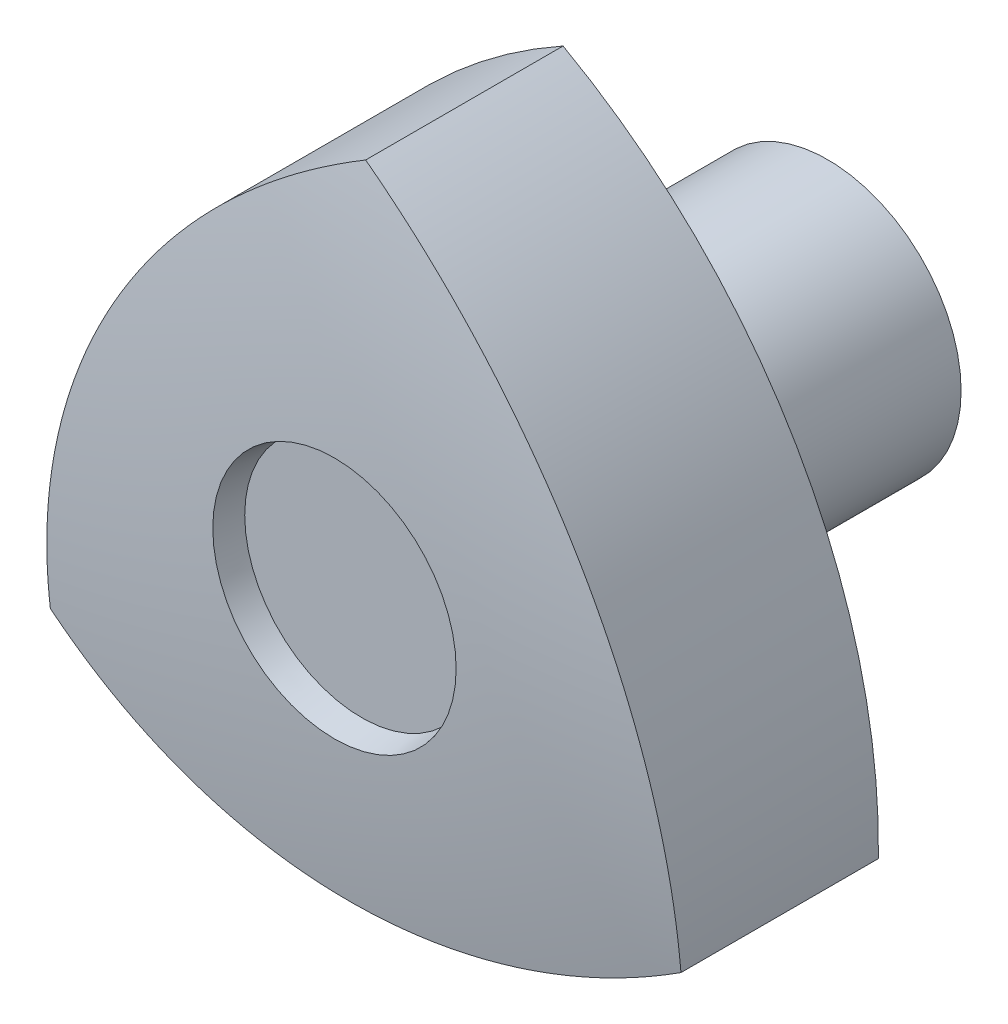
ISO-10303-21;
HEADER;
FILE_DESCRIPTION(('STEP AP214'),'2;1');
FILE_NAME('part.step','',(''),(''),'','','');
FILE_SCHEMA(('AUTOMOTIVE_DESIGN { 1 0 10303 214 1 1 1 1 }'));
ENDSEC;
DATA;
#1=APPLICATION_CONTEXT('core data for automotive mechanical design processes');
#2=APPLICATION_PROTOCOL_DEFINITION('international standard','automotive_design',2000,#1);
#3=PRODUCT_CONTEXT('',#1,'mechanical');
#4=PRODUCT('Part','Part','',(#3));
#5=PRODUCT_RELATED_PRODUCT_CATEGORY('part','',(#4));
#6=PRODUCT_DEFINITION_FORMATION('','',#4);
#7=PRODUCT_DEFINITION_CONTEXT('part definition',#1,'design');
#8=PRODUCT_DEFINITION('design','',#6,#7);
#9=PRODUCT_DEFINITION_SHAPE('','',#8);
#10=(LENGTH_UNIT() NAMED_UNIT(*) SI_UNIT(.MILLI.,.METRE.));
#11=(NAMED_UNIT(*) PLANE_ANGLE_UNIT() SI_UNIT($,.RADIAN.));
#12=(NAMED_UNIT(*) SI_UNIT($,.STERADIAN.) SOLID_ANGLE_UNIT());
#13=UNCERTAINTY_MEASURE_WITH_UNIT(LENGTH_MEASURE(1.E-05),#10,'distance_accuracy_value','');
#14=(GEOMETRIC_REPRESENTATION_CONTEXT(3) GLOBAL_UNCERTAINTY_ASSIGNED_CONTEXT((#13)) GLOBAL_UNIT_ASSIGNED_CONTEXT((#10,
#11,#12)) REPRESENTATION_CONTEXT('',''));
#15=CARTESIAN_POINT('',(0.,0.,0.));
#16=DIRECTION('',(0.,0.,1.));
#17=DIRECTION('',(1.,0.,0.));
#18=AXIS2_PLACEMENT_3D('',#15,#16,#17);
#19=CARTESIAN_POINT('',(0.,-6.,0.));
#20=DIRECTION('',(0.,0.,1.));
#21=DIRECTION('',(-1.,0.,0.));
#22=AXIS2_PLACEMENT_3D('',#19,#20,#21);
#23=PLANE('',#22);
#24=CARTESIAN_POINT('',(0.,0.,0.));
#25=DIRECTION('',(0.,0.,-1.));
#26=DIRECTION('',(-1.,0.,0.));
#27=AXIS2_PLACEMENT_3D('',#24,#25,#26);
#28=CIRCLE('',#27,6.);
#29=CARTESIAN_POINT('',(-6.,0.,0.));
#30=VERTEX_POINT('',#29);
#31=EDGE_CURVE('E126',#30,#30,#28,.T.);
#32=ORIENTED_EDGE('',*,*,#31,.F.);
#33=EDGE_LOOP('',(#32));
#34=FACE_BOUND('',#33,.T.);
#35=CARTESIAN_POINT('',(0.,0.,0.));
#36=DIRECTION('',(0.,0.,-1.));
#37=DIRECTION('',(1.,0.,0.));
#38=AXIS2_PLACEMENT_3D('',#35,#36,#37);
#39=CIRCLE('',#38,7.8);
#40=CARTESIAN_POINT('',(7.8,0.,0.));
#41=VERTEX_POINT('',#40);
#42=EDGE_CURVE('E117',#41,#41,#39,.F.);
#43=ORIENTED_EDGE('',*,*,#42,.F.);
#44=EDGE_LOOP('',(#43));
#45=FACE_BOUND('',#44,.T.);
#46=ADVANCED_FACE('F14',(#34,#45),#23,.F.);
#47=CARTESIAN_POINT('',(0.,0.,38.6));
#48=DIRECTION('',(0.,0.,-1.));
#49=DIRECTION('',(1.,0.,0.));
#50=AXIS2_PLACEMENT_3D('',#47,#48,#49);
#51=CYLINDRICAL_SURFACE('',#50,7.8);
#52=ORIENTED_EDGE('',*,*,#42,.T.);
#53=EDGE_LOOP('',(#52));
#54=FACE_BOUND('',#53,.T.);
#55=CARTESIAN_POINT('',(0.,0.,0.200000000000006));
#56=DIRECTION('',(0.,0.,-1.));
#57=DIRECTION('',(1.,0.,0.));
#58=AXIS2_PLACEMENT_3D('',#55,#56,#57);
#59=CIRCLE('',#58,7.8);
#60=CARTESIAN_POINT('',(7.8,0.,0.200000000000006));
#61=VERTEX_POINT('',#60);
#62=EDGE_CURVE('E115',#61,#61,#59,.T.);
#63=ORIENTED_EDGE('',*,*,#62,.T.);
#64=EDGE_LOOP('',(#63));
#65=FACE_BOUND('',#64,.T.);
#66=ADVANCED_FACE('F166',(#54,#65),#51,.T.);
#67=CARTESIAN_POINT('',(0.,-7.8,0.200000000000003));
#68=DIRECTION('',(0.,0.,1.));
#69=DIRECTION('',(-1.,0.,0.));
#70=AXIS2_PLACEMENT_3D('',#67,#68,#69);
#71=PLANE('',#70);
#72=ORIENTED_EDGE('',*,*,#62,.F.);
#73=EDGE_LOOP('',(#72));
#74=FACE_BOUND('',#73,.T.);
#75=CARTESIAN_POINT('',(0.,0.,0.200000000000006));
#76=DIRECTION('',(0.,0.,-1.));
#77=DIRECTION('',(1.,0.,0.));
#78=AXIS2_PLACEMENT_3D('',#75,#76,#77);
#79=CIRCLE('',#78,11.);
#80=CARTESIAN_POINT('',(11.,0.,0.200000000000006));
#81=VERTEX_POINT('',#80);
#82=EDGE_CURVE('E112',#81,#81,#79,.F.);
#83=ORIENTED_EDGE('',*,*,#82,.F.);
#84=EDGE_LOOP('',(#83));
#85=FACE_BOUND('',#84,.T.);
#86=ADVANCED_FACE('F159',(#74,#85),#71,.F.);
#87=CARTESIAN_POINT('',(0.,0.,38.6));
#88=DIRECTION('',(0.,0.,-1.));
#89=DIRECTION('',(1.,0.,0.));
#90=AXIS2_PLACEMENT_3D('',#87,#88,#89);
#91=CYLINDRICAL_SURFACE('',#90,11.);
#92=ORIENTED_EDGE('',*,*,#82,.T.);
#93=EDGE_LOOP('',(#92));
#94=FACE_BOUND('',#93,.T.);
#95=CARTESIAN_POINT('',(0.,0.,22.));
#96=DIRECTION('',(0.,0.,-1.));
#97=DIRECTION('',(1.,0.,0.));
#98=AXIS2_PLACEMENT_3D('',#95,#96,#97);
#99=CIRCLE('',#98,11.);
#100=CARTESIAN_POINT('',(11.,0.,22.));
#101=VERTEX_POINT('',#100);
#102=EDGE_CURVE('E58',#101,#101,#99,.T.);
#103=ORIENTED_EDGE('',*,*,#102,.T.);
#104=EDGE_LOOP('',(#103));
#105=FACE_BOUND('',#104,.T.);
#106=ADVANCED_FACE('F154',(#94,#105),#91,.T.);
#107=CARTESIAN_POINT('',(0.,-11.,22.));
#108=DIRECTION('',(0.,0.,1.));
#109=DIRECTION('',(-1.,0.,0.));
#110=AXIS2_PLACEMENT_3D('',#107,#108,#109);
#111=PLANE('',#110);
#112=ORIENTED_EDGE('',*,*,#102,.F.);
#113=EDGE_LOOP('',(#112));
#114=FACE_BOUND('',#113,.T.);
#115=CARTESIAN_POINT('',(24.4868682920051,-14.1375,22.));
#116=DIRECTION('',(0.,0.,1.));
#117=DIRECTION('',(-1.,0.,0.));
#118=AXIS2_PLACEMENT_3D('',#115,#116,#117);
#119=CIRCLE('',#118,50.475);
#120=CARTESIAN_POINT('',(0.,30.,22.));
#121=VERTEX_POINT('',#120);
#122=CARTESIAN_POINT('',(-25.9807621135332,-14.9999999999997,22.));
#123=VERTEX_POINT('',#122);
#124=EDGE_CURVE('E62',#121,#123,#119,.T.);
#125=ORIENTED_EDGE('',*,*,#124,.F.);
#126=CARTESIAN_POINT('',(-24.486868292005,-14.1375,22.));
#127=DIRECTION('',(0.,0.,1.));
#128=DIRECTION('',(-1.,0.,0.));
#129=AXIS2_PLACEMENT_3D('',#126,#127,#128);
#130=CIRCLE('',#129,50.475);
#131=CARTESIAN_POINT('',(25.9807621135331,-15.,22.));
#132=VERTEX_POINT('',#131);
#133=EDGE_CURVE('E60',#132,#121,#130,.T.);
#134=ORIENTED_EDGE('',*,*,#133,.F.);
#135=CARTESIAN_POINT('',(0.,28.275,22.));
#136=DIRECTION('',(0.,0.,1.));
#137=DIRECTION('',(-1.,0.,0.));
#138=AXIS2_PLACEMENT_3D('',#135,#136,#137);
#139=CIRCLE('',#138,50.475);
#140=EDGE_CURVE('E49',#123,#132,#139,.T.);
#141=ORIENTED_EDGE('',*,*,#140,.F.);
#142=EDGE_LOOP('',(#125,#134,#141));
#143=FACE_BOUND('',#142,.T.);
#144=ADVANCED_FACE('F61',(#114,#143),#111,.F.);
#145=CARTESIAN_POINT('',(0.,-9.63233580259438,38.6));
#146=DIRECTION('',(0.,0.,-1.));
#147=DIRECTION('',(1.,0.,0.));
#148=AXIS2_PLACEMENT_3D('',#145,#146,#147);
#149=PLANE('',#148);
#150=CARTESIAN_POINT('',(0.,0.,38.6));
#151=DIRECTION('',(0.,0.,1.));
#152=DIRECTION('',(-1.,0.,0.));
#153=AXIS2_PLACEMENT_3D('',#150,#151,#152);
#154=CIRCLE('',#153,9.63233580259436);
#155=CARTESIAN_POINT('',(-9.63233580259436,0.,38.6));
#156=VERTEX_POINT('',#155);
#157=EDGE_CURVE('E106',#156,#156,#154,.T.);
#158=ORIENTED_EDGE('',*,*,#157,.T.);
#159=EDGE_LOOP('',(#158));
#160=FACE_BOUND('',#159,.T.);
#161=ADVANCED_FACE('F98',(#160),#149,.F.);
#162=CARTESIAN_POINT('',(0.,28.275,60.));
#163=DIRECTION('',(0.,0.,1.));
#164=DIRECTION('',(-1.,0.,0.));
#165=AXIS2_PLACEMENT_3D('',#162,#163,#164);
#166=CYLINDRICAL_SURFACE('',#165,50.475);
#167=DIRECTION('',(0.,0.,1.));
#168=VECTOR('',#167,1.);
#169=CARTESIAN_POINT('',(-25.9807621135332,-14.9999999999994,60.));
#170=LINE('',#169,#168);
#171=CARTESIAN_POINT('',(-25.9807621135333,-14.9999999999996,38.2666666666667));
#172=VERTEX_POINT('',#171);
#173=EDGE_CURVE('E56',#123,#172,#170,.T.);
#174=ORIENTED_EDGE('',*,*,#173,.F.);
#175=ORIENTED_EDGE('',*,*,#140,.T.);
#176=DIRECTION('',(0.,0.,1.));
#177=VECTOR('',#176,1.);
#178=CARTESIAN_POINT('',(25.9807621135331,-15.0000000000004,60.));
#179=LINE('',#178,#177);
#180=CARTESIAN_POINT('',(25.9807621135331,-15.0000000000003,38.2666666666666));
#181=VERTEX_POINT('',#180);
#182=EDGE_CURVE('E54',#181,#132,#179,.F.);
#183=ORIENTED_EDGE('',*,*,#182,.F.);
#184=CARTESIAN_POINT('',(-25.9807621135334,-14.9999999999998,38.2666666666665));
#185=CARTESIAN_POINT('',(-25.4333646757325,-15.3286377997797,38.3303674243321));
#186=CARTESIAN_POINT('',(-24.8796016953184,-15.6469655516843,38.3919197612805));
#187=CARTESIAN_POINT('',(-23.7600350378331,-16.2625632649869,38.5106833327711));
#188=CARTESIAN_POINT('',(-23.1942313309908,-16.5598331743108,38.5678945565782));
#189=CARTESIAN_POINT('',(-21.4800854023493,-17.419253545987,38.73292211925));
#190=CARTESIAN_POINT('',(-20.314733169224,-17.9491798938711,38.8341643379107));
#191=CARTESIAN_POINT('',(-17.9460386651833,-18.919318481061,39.0187399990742));
#192=CARTESIAN_POINT('',(-16.7426967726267,-19.3595316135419,39.1020736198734));
#193=CARTESIAN_POINT('',(-14.3049330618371,-20.1474680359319,39.2506711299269));
#194=CARTESIAN_POINT('',(-13.0705096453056,-20.4951865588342,39.3159340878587));
#195=CARTESIAN_POINT('',(-10.461080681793,-21.1239590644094,39.4335816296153));
#196=CARTESIAN_POINT('',(-9.08374319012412,-21.3957097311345,39.484185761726));
#197=CARTESIAN_POINT('',(-6.31052709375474,-21.8236189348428,39.5636971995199));
#198=CARTESIAN_POINT('',(-4.91464705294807,-21.9797684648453,39.592602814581));
#199=CARTESIAN_POINT('',(-2.11416082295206,-22.1752381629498,39.6287660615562));
#200=CARTESIAN_POINT('',(-0.709552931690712,-22.2145347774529,39.6360193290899));
#201=CARTESIAN_POINT('',(2.09792344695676,-22.1759176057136,39.6288830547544));
#202=CARTESIAN_POINT('',(3.50079202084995,-22.0980099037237,39.6144946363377));
#203=CARTESIAN_POINT('',(6.28771921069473,-21.826303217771,39.5641714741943));
#204=CARTESIAN_POINT('',(7.67183699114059,-21.6330902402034,39.5283456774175));
#205=CARTESIAN_POINT('',(10.4187751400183,-21.1327305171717,39.4351850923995));
#206=CARTESIAN_POINT('',(11.7815929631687,-20.8255702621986,39.3778477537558));
#207=CARTESIAN_POINT('',(14.474536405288,-20.1001609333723,39.2417613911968));
#208=CARTESIAN_POINT('',(15.8046966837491,-19.6820357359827,39.1630362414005));
#209=CARTESIAN_POINT('',(18.4242372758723,-18.7378678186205,38.984301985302));
#210=CARTESIAN_POINT('',(19.7136361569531,-18.2118750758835,38.8843027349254));
#211=CARTESIAN_POINT('',(21.4075776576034,-17.4378499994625,38.7363291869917));
#212=CARTESIAN_POINT('',(21.8342926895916,-17.235573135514,38.6975947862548));
#213=CARTESIAN_POINT('',(22.6816334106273,-16.8192546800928,38.6177315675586));
#214=CARTESIAN_POINT('',(23.1022604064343,-16.6052156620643,38.5766032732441));
#215=CARTESIAN_POINT('',(23.9363879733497,-16.1659355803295,38.4920437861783));
#216=CARTESIAN_POINT('',(24.349900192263,-15.9407157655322,38.4486169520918));
#217=CARTESIAN_POINT('',(25.1703585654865,-15.4788612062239,38.3594040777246));
#218=CARTESIAN_POINT('',(25.5773033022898,-15.2422240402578,38.3136175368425));
#219=CARTESIAN_POINT('',(25.980762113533,-15.,38.2666666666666));
#220=B_SPLINE_CURVE_WITH_KNOTS('',3,(#184,#185,#186,#187,#188,#189,#190,#191,#192,#193,#194,
#195,#196,#197,#198,#199,#200,#201,#202,#203,#204,#205,#206,#207,#208,#209,#210,#211,#212,#213,
#214,#215,#216,#217,#218,#219),.UNSPECIFIED.,.F.,.F.,(4,2,2,2,2,2,2,2,2,2,2,2,2,2,2,2,2,4),(0.,
1.92468080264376,3.84936636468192,7.69777230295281,11.5461399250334,15.3947058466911,
19.6039988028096,23.8136196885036,28.0240890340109,32.2343398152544,36.4233732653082,
40.6129035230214,44.7977763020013,48.9807145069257,50.4020406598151,51.8230570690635,
53.241469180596,54.660183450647),.UNSPECIFIED.);
#221=EDGE_CURVE('E100',#172,#181,#220,.T.);
#222=ORIENTED_EDGE('',*,*,#221,.F.);
#223=EDGE_LOOP('',(#174,#175,#183,#222));
#224=FACE_BOUND('',#223,.T.);
#225=ADVANCED_FACE('F52',(#224),#166,.T.);
#226=CARTESIAN_POINT('',(-24.486868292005,-14.1375,60.));
#227=DIRECTION('',(0.,0.,1.));
#228=DIRECTION('',(-1.,0.,0.));
#229=AXIS2_PLACEMENT_3D('',#226,#227,#228);
#230=CYLINDRICAL_SURFACE('',#229,50.475);
#231=ORIENTED_EDGE('',*,*,#182,.T.);
#232=ORIENTED_EDGE('',*,*,#133,.T.);
#233=DIRECTION('',(0.,0.,1.));
#234=VECTOR('',#233,1.);
#235=CARTESIAN_POINT('',(0.,30.,60.));
#236=LINE('',#235,#234);
#237=CARTESIAN_POINT('',(0.,30.,38.2666666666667));
#238=VERTEX_POINT('',#237);
#239=EDGE_CURVE('E34',#238,#121,#236,.F.);
#240=ORIENTED_EDGE('',*,*,#239,.F.);
#241=CARTESIAN_POINT('',(25.9807621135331,-15.0000000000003,38.2666666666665));
#242=CARTESIAN_POINT('',(25.9916720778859,-14.3616210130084,38.3303674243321));
#243=CARTESIAN_POINT('',(25.9904705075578,-13.7228843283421,38.3919197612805));
#244=CARTESIAN_POINT('',(25.9638104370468,-12.4455123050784,38.5106833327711));
#245=CARTESIAN_POINT('',(25.9383518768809,-11.8068769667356,38.5678945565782));
#246=CARTESIAN_POINT('',(25.8255587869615,-9.89267286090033,38.7329221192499));
#247=CARTESIAN_POINT('',(25.7018123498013,-8.61848504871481,38.8341643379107));
#248=CARTESIAN_POINT('',(25.3576297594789,-6.08206614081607,39.0187399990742));
#249=CARTESIAN_POINT('',(25.1371945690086,-4.81983492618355,39.1020736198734));
#250=CARTESIAN_POINT('',(24.6006856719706,-2.31470141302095,39.2506711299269));
#251=CARTESIAN_POINT('',(24.2846070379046,-1.07180011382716,39.3159340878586));
#252=CARTESIAN_POINT('',(23.5244255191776,1.50241791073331,39.4335816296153));
#253=CARTESIAN_POINT('',(23.0710997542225,2.83110250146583,39.484185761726));
#254=CARTESIAN_POINT('',(22.0550719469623,5.44673269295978,39.5636971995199));
#255=CARTESIAN_POINT('',(21.4923613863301,6.73367503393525,39.592602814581));
#256=CARTESIAN_POINT('',(20.2613999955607,9.25670210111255,39.6287660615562));
#257=CARTESIAN_POINT('',(19.5931279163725,10.4927765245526,39.6360193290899));
#258=CARTESIAN_POINT('',(18.1559462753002,12.9048138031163,39.6288830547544));
#259=CARTESIAN_POINT('',(17.3870419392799,14.0807797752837,39.6144946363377));
#260=CARTESIAN_POINT('',(15.7582734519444,16.3584761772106,39.5641714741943));
#261=CARTESIAN_POINT('',(14.8988872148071,17.4605508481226,39.5283456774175));
#262=CARTESIAN_POINT('',(13.0920939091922,19.5892892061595,39.4351850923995));
#263=CARTESIAN_POINT('',(12.1446764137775,20.6159439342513,39.3778477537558));
#264=CARTESIAN_POINT('',(10.1699817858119,22.5853967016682,39.2417613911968));
#265=CARTESIAN_POINT('',(9.14279460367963,23.5282866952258,39.1630362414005));
#266=CARTESIAN_POINT('',(7.01535090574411,25.3247914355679,38.984301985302));
#267=CARTESIAN_POINT('',(5.91512838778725,26.1784472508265,38.8843027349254));
#268=CARTESIAN_POINT('',(4.3978322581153,27.258431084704,38.7363291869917));
#269=CARTESIAN_POINT('',(4.00929783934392,27.5268387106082,38.6975947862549));
#270=CARTESIAN_POINT('',(3.22508512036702,28.0524980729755,38.6177315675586));
#271=CARTESIAN_POINT('',(2.82940839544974,28.3097522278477,38.5766032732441));
#272=CARTESIAN_POINT('',(2.03191690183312,28.812487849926,38.4920437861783));
#273=CARTESIAN_POINT('',(1.63011471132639,29.0579900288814,38.4486169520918));
#274=CARTESIAN_POINT('',(0.819907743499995,29.5376005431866,38.3594040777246));
#275=CARTESIAN_POINT('',(0.411501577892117,29.7717064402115,38.3136175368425));
#276=CARTESIAN_POINT('',(0.,30.,38.2666666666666));
#277=B_SPLINE_CURVE_WITH_KNOTS('',3,(#241,#242,#243,#244,#245,#246,#247,#248,#249,#250,#251,
#252,#253,#254,#255,#256,#257,#258,#259,#260,#261,#262,#263,#264,#265,#266,#267,#268,#269,#270,
#271,#272,#273,#274,#275,#276),.UNSPECIFIED.,.F.,.F.,(4,2,2,2,2,2,2,2,2,2,2,2,2,2,2,2,2,4),(0.,
1.92468080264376,3.84936636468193,7.69777230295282,11.5461399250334,15.3947058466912,
19.6039988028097,23.8136196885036,28.024089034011,32.2343398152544,36.4233732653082,
40.6129035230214,44.7977763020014,48.9807145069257,50.4020406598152,51.8230570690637,
53.2414691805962,54.6601834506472),.UNSPECIFIED.);
#278=EDGE_CURVE('E66',#181,#238,#277,.T.);
#279=ORIENTED_EDGE('',*,*,#278,.F.);
#280=EDGE_LOOP('',(#231,#232,#240,#279));
#281=FACE_BOUND('',#280,.T.);
#282=ADVANCED_FACE('F64',(#281),#230,.T.);
#283=CARTESIAN_POINT('',(24.4868682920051,-14.1375,60.));
#284=DIRECTION('',(0.,0.,1.));
#285=DIRECTION('',(-1.,0.,0.));
#286=AXIS2_PLACEMENT_3D('',#283,#284,#285);
#287=CYLINDRICAL_SURFACE('',#286,50.475);
#288=ORIENTED_EDGE('',*,*,#239,.T.);
#289=ORIENTED_EDGE('',*,*,#124,.T.);
#290=ORIENTED_EDGE('',*,*,#173,.T.);
#291=CARTESIAN_POINT('',(0.,30.,38.2666666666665));
#292=CARTESIAN_POINT('',(-0.558307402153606,29.6902588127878,38.3303674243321));
#293=CARTESIAN_POINT('',(-1.1108688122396,29.3698498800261,38.3919197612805));
#294=CARTESIAN_POINT('',(-2.20377539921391,28.7080755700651,38.5106833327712));
#295=CARTESIAN_POINT('',(-2.74412054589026,28.3667101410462,38.5678945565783));
#296=CARTESIAN_POINT('',(-4.34547338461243,27.311926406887,38.73292211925));
#297=CARTESIAN_POINT('',(-5.38707918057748,26.5676649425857,38.8341643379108));
#298=CARTESIAN_POINT('',(-7.41159109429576,25.0013846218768,39.0187399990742));
#299=CARTESIAN_POINT('',(-8.39449779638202,24.1793665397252,39.1020736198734));
#300=CARTESIAN_POINT('',(-10.2957526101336,22.4621694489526,39.2506711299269));
#301=CARTESIAN_POINT('',(-11.2140973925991,21.5669866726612,39.3159340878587));
#302=CARTESIAN_POINT('',(-13.0633448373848,19.6215411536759,39.4335816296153));
#303=CARTESIAN_POINT('',(-13.9873565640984,18.5646072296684,39.484185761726));
#304=CARTESIAN_POINT('',(-15.7445448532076,16.3768862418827,39.56369719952));
#305=CARTESIAN_POINT('',(-16.5777143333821,15.2460934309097,39.592602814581));
#306=CARTESIAN_POINT('',(-18.1472391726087,12.9185360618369,39.6287660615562));
#307=CARTESIAN_POINT('',(-18.8835749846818,11.7217582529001,39.6360193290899));
#308=CARTESIAN_POINT('',(-20.253869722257,9.27110380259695,39.6288830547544));
#309=CARTESIAN_POINT('',(-20.8878339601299,8.01723012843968,39.6144946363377));
#310=CARTESIAN_POINT('',(-22.0459926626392,5.4678270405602,39.5641714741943));
#311=CARTESIAN_POINT('',(-22.5707242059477,4.17253939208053,39.5283456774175));
#312=CARTESIAN_POINT('',(-23.5108690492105,1.54344131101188,39.4351850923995));
#313=CARTESIAN_POINT('',(-23.9262693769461,0.209626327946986,39.3778477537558));
#314=CARTESIAN_POINT('',(-24.6445181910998,-2.48523576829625,39.2417613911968));
#315=CARTESIAN_POINT('',(-24.9474912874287,-3.84625095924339,39.1630362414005));
#316=CARTESIAN_POINT('',(-25.4395881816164,-6.58692361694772,38.9843019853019));
#317=CARTESIAN_POINT('',(-25.6287645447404,-7.96657217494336,38.8843027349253));
#318=CARTESIAN_POINT('',(-25.8054099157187,-9.82058108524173,38.7363291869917));
#319=CARTESIAN_POINT('',(-25.8435905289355,-10.2912655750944,38.6975947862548));
#320=CARTESIAN_POINT('',(-25.9067185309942,-11.2332433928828,38.6177315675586));
#321=CARTESIAN_POINT('',(-25.931668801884,-11.7045365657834,38.5766032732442));
#322=CARTESIAN_POINT('',(-25.9683048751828,-12.6465522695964,38.4920437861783));
#323=CARTESIAN_POINT('',(-25.9800149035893,-13.1172742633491,38.4486169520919));
#324=CARTESIAN_POINT('',(-25.9902663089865,-14.0587393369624,38.3594040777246));
#325=CARTESIAN_POINT('',(-25.988804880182,-14.5294823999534,38.3136175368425));
#326=CARTESIAN_POINT('',(-25.9807621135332,-14.9999999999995,38.2666666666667));
#327=B_SPLINE_CURVE_WITH_KNOTS('',3,(#291,#292,#293,#294,#295,#296,#297,#298,#299,#300,#301,
#302,#303,#304,#305,#306,#307,#308,#309,#310,#311,#312,#313,#314,#315,#316,#317,#318,#319,#320,
#321,#322,#323,#324,#325,#326),.UNSPECIFIED.,.F.,.F.,(4,2,2,2,2,2,2,2,2,2,2,2,2,2,2,2,2,4),(0.,
1.92468080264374,3.84936636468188,7.69777230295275,11.5461399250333,15.394705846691,
19.6039988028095,23.8136196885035,28.0240890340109,32.2343398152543,36.4233732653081,
40.6129035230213,44.7977763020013,48.9807145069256,50.4020406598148,51.8230570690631,
53.2414691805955,54.6601834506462),.UNSPECIFIED.);
#328=EDGE_CURVE('E25',#238,#172,#327,.T.);
#329=ORIENTED_EDGE('',*,*,#328,.F.);
#330=EDGE_LOOP('',(#288,#289,#290,#329));
#331=FACE_BOUND('',#330,.T.);
#332=ADVANCED_FACE('F85',(#331),#287,.T.);
#333=CARTESIAN_POINT('',(0.,0.,40.8385861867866));
#334=DIRECTION('',(0.,0.,1.));
#335=DIRECTION('',(-1.,0.,0.));
#336=AXIS2_PLACEMENT_3D('',#333,#334,#335);
#337=CONICAL_SURFACE('',#336,10.027058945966,0.174532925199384);
#338=CARTESIAN_POINT('',(0.,0.,40.8385861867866));
#339=DIRECTION('',(0.,0.,-1.));
#340=DIRECTION('',(1.,0.,0.));
#341=AXIS2_PLACEMENT_3D('',#338,#339,#340);
#342=CIRCLE('',#341,10.027058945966);
#343=CARTESIAN_POINT('',(10.027058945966,0.,40.8385861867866));
#344=VERTEX_POINT('',#343);
#345=EDGE_CURVE('E9',#344,#344,#342,.T.);
#346=ORIENTED_EDGE('',*,*,#345,.F.);
#347=EDGE_LOOP('',(#346));
#348=FACE_BOUND('',#347,.T.);
#349=ORIENTED_EDGE('',*,*,#157,.F.);
#350=EDGE_LOOP('',(#349));
#351=FACE_BOUND('',#350,.T.);
#352=ADVANCED_FACE('F89',(#348,#351),#337,.F.);
#353=CARTESIAN_POINT('',(0.,0.,-93.7719850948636));
#354=DIRECTION('',(0.,0.,1.));
#355=DIRECTION('',(-1.,0.,0.));
#356=AXIS2_PLACEMENT_3D('',#353,#354,#355);
#357=DEGENERATE_TOROIDAL_SURFACE('',#356,2.84529320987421,134.802016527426,.T.);
#358=ORIENTED_EDGE('',*,*,#345,.T.);
#359=EDGE_LOOP('',(#358));
#360=FACE_BOUND('',#359,.T.);
#361=ORIENTED_EDGE('',*,*,#278,.T.);
#362=ORIENTED_EDGE('',*,*,#328,.T.);
#363=ORIENTED_EDGE('',*,*,#221,.T.);
#364=EDGE_LOOP('',(#361,#362,#363));
#365=FACE_BOUND('',#364,.T.);
#366=ADVANCED_FACE('F16',(#360,#365),#357,.T.);
#367=CARTESIAN_POINT('',(0.,0.,18.));
#368=DIRECTION('',(0.,0.,-1.));
#369=DIRECTION('',(-1.,0.,0.));
#370=AXIS2_PLACEMENT_3D('',#367,#368,#369);
#371=CYLINDRICAL_SURFACE('',#370,6.);
#372=CARTESIAN_POINT('',(0.,0.,18.));
#373=DIRECTION('',(0.,0.,-1.));
#374=DIRECTION('',(-1.,0.,0.));
#375=AXIS2_PLACEMENT_3D('',#372,#373,#374);
#376=CIRCLE('',#375,6.);
#377=CARTESIAN_POINT('',(-6.,0.,18.));
#378=VERTEX_POINT('',#377);
#379=EDGE_CURVE('E122',#378,#378,#376,.T.);
#380=ORIENTED_EDGE('',*,*,#379,.F.);
#381=EDGE_LOOP('',(#380));
#382=FACE_BOUND('',#381,.T.);
#383=ORIENTED_EDGE('',*,*,#31,.T.);
#384=EDGE_LOOP('',(#383));
#385=FACE_BOUND('',#384,.T.);
#386=ADVANCED_FACE('F136',(#382,#385),#371,.F.);
#387=CARTESIAN_POINT('',(0.,0.,37.));
#388=DIRECTION('',(0.,0.,1.));
#389=DIRECTION('',(-1.,0.,0.));
#390=AXIS2_PLACEMENT_3D('',#387,#388,#389);
#391=PLANE('',#390);
#392=CARTESIAN_POINT('',(0.,0.,37.));
#393=DIRECTION('',(0.,0.,1.));
#394=DIRECTION('',(0.,-1.,0.));
#395=AXIS2_PLACEMENT_3D('',#392,#393,#394);
#396=CIRCLE('',#395,9.35021263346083);
#397=CARTESIAN_POINT('',(0.,-9.35021263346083,37.));
#398=VERTEX_POINT('',#397);
#399=EDGE_CURVE('E19',#398,#398,#396,.F.);
#400=ORIENTED_EDGE('',*,*,#399,.T.);
#401=EDGE_LOOP('',(#400));
#402=FACE_BOUND('',#401,.T.);
#403=ADVANCED_FACE('F143',(#402),#391,.F.);
#404=CARTESIAN_POINT('',(0.,0.,37.));
#405=DIRECTION('',(0.,0.,1.));
#406=DIRECTION('',(0.,-1.,0.));
#407=AXIS2_PLACEMENT_3D('',#404,#405,#406);
#408=CONICAL_SURFACE('',#407,9.35021263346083,0.174532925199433);
#409=ORIENTED_EDGE('',*,*,#399,.F.);
#410=EDGE_LOOP('',(#409));
#411=FACE_BOUND('',#410,.T.);
#412=ORIENTED_EDGE('',*,*,#379,.T.);
#413=EDGE_LOOP('',(#412));
#414=FACE_BOUND('',#413,.T.);
#415=ADVANCED_FACE('F173',(#411,#414),#408,.F.);
#416=CLOSED_SHELL('',(#46,#66,#86,#106,#144,#161,#225,#282,#332,#352,#366,#386,#403,#415));
#417=MANIFOLD_SOLID_BREP('B1',#416);
#418=ADVANCED_BREP_SHAPE_REPRESENTATION('',(#18,#417),#14);
#419=SHAPE_DEFINITION_REPRESENTATION(#9,#418);
ENDSEC;
END-ISO-10303-21;
